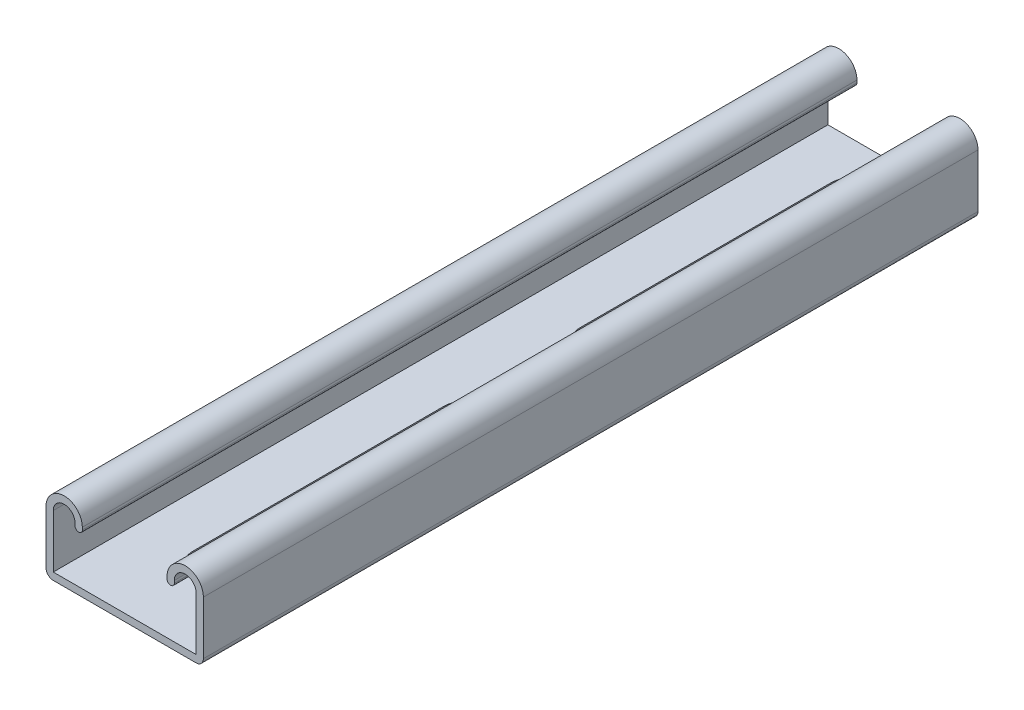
ISO-10303-21;
HEADER;
FILE_DESCRIPTION(('STEP AP214'),'2;1');
FILE_NAME('part.step','',(''),(''),'','','');
FILE_SCHEMA(('AUTOMOTIVE_DESIGN { 1 0 10303 214 1 1 1 1 }'));
ENDSEC;
DATA;
#1=APPLICATION_CONTEXT('core data for automotive mechanical design processes');
#2=APPLICATION_PROTOCOL_DEFINITION('international standard','automotive_design',2000,#1);
#3=PRODUCT_CONTEXT('',#1,'mechanical');
#4=PRODUCT('Part','Part','',(#3));
#5=PRODUCT_RELATED_PRODUCT_CATEGORY('part','',(#4));
#6=PRODUCT_DEFINITION_FORMATION('','',#4);
#7=PRODUCT_DEFINITION_CONTEXT('part definition',#1,'design');
#8=PRODUCT_DEFINITION('design','',#6,#7);
#9=PRODUCT_DEFINITION_SHAPE('','',#8);
#10=(LENGTH_UNIT() NAMED_UNIT(*) SI_UNIT(.MILLI.,.METRE.));
#11=(NAMED_UNIT(*) PLANE_ANGLE_UNIT() SI_UNIT($,.RADIAN.));
#12=(NAMED_UNIT(*) SI_UNIT($,.STERADIAN.) SOLID_ANGLE_UNIT());
#13=UNCERTAINTY_MEASURE_WITH_UNIT(LENGTH_MEASURE(1.E-05),#10,'distance_accuracy_value','');
#14=(GEOMETRIC_REPRESENTATION_CONTEXT(3) GLOBAL_UNCERTAINTY_ASSIGNED_CONTEXT((#13)) GLOBAL_UNIT_ASSIGNED_CONTEXT((#10,
#11,#12)) REPRESENTATION_CONTEXT('',''));
#15=CARTESIAN_POINT('',(0.,0.,0.));
#16=DIRECTION('',(0.,0.,1.));
#17=DIRECTION('',(1.,0.,0.));
#18=AXIS2_PLACEMENT_3D('',#15,#16,#17);
#19=CARTESIAN_POINT('',(-15.875,7.4295,203.2));
#20=DIRECTION('',(0.,0.,-1.));
#21=DIRECTION('',(-1.,0.,0.));
#22=AXIS2_PLACEMENT_3D('',#19,#20,#21);
#23=CYLINDRICAL_SURFACE('',#22,4.7625);
#24=CARTESIAN_POINT('',(-15.875,7.4295,0.));
#25=DIRECTION('',(0.,0.,1.));
#26=DIRECTION('',(-1.,0.,0.));
#27=AXIS2_PLACEMENT_3D('',#24,#25,#26);
#28=CIRCLE('',#27,4.7625);
#29=CARTESIAN_POINT('',(-11.1125,7.4295,0.));
#30=VERTEX_POINT('',#29);
#31=CARTESIAN_POINT('',(-20.6375,7.4295,0.));
#32=VERTEX_POINT('',#31);
#33=EDGE_CURVE('E253',#30,#32,#28,.T.);
#34=ORIENTED_EDGE('',*,*,#33,.T.);
#35=DIRECTION('',(0.,0.,-1.));
#36=VECTOR('',#35,1.);
#37=CARTESIAN_POINT('',(-20.6375,7.4295,203.2));
#38=LINE('',#37,#36);
#39=CARTESIAN_POINT('',(-20.6375,7.4295,203.2));
#40=VERTEX_POINT('',#39);
#41=EDGE_CURVE('E384',#40,#32,#38,.T.);
#42=ORIENTED_EDGE('',*,*,#41,.F.);
#43=CARTESIAN_POINT('',(-15.875,7.4295,203.2));
#44=DIRECTION('',(0.,0.,1.));
#45=DIRECTION('',(-1.,0.,0.));
#46=AXIS2_PLACEMENT_3D('',#43,#44,#45);
#47=CIRCLE('',#46,4.7625);
#48=CARTESIAN_POINT('',(-11.1125,7.4295,203.2));
#49=VERTEX_POINT('',#48);
#50=EDGE_CURVE('E260',#49,#40,#47,.T.);
#51=ORIENTED_EDGE('',*,*,#50,.F.);
#52=DIRECTION('',(0.,0.,-1.));
#53=VECTOR('',#52,1.);
#54=CARTESIAN_POINT('',(-11.1125,7.4295,203.2));
#55=LINE('',#54,#53);
#56=EDGE_CURVE('E298',#49,#30,#55,.T.);
#57=ORIENTED_EDGE('',*,*,#56,.T.);
#58=EDGE_LOOP('',(#34,#42,#51,#57));
#59=FACE_BOUND('',#58,.T.);
#60=ADVANCED_FACE('F32',(#59),#23,.T.);
#61=CARTESIAN_POINT('',(-20.6375,7.4295,203.2));
#62=DIRECTION('',(1.,0.,0.));
#63=DIRECTION('',(0.,0.,-1.));
#64=AXIS2_PLACEMENT_3D('',#61,#62,#63);
#65=PLANE('',#64);
#66=DIRECTION('',(0.,-1.,0.));
#67=VECTOR('',#66,1.);
#68=CARTESIAN_POINT('',(-20.6375,7.4295,0.));
#69=LINE('',#68,#67);
#70=CARTESIAN_POINT('',(-20.6375,-6.5532,0.));
#71=VERTEX_POINT('',#70);
#72=EDGE_CURVE('E301',#32,#71,#69,.T.);
#73=ORIENTED_EDGE('',*,*,#72,.T.);
#74=DIRECTION('',(0.,0.,-1.));
#75=VECTOR('',#74,1.);
#76=CARTESIAN_POINT('',(-20.6375,-6.5532,203.2));
#77=LINE('',#76,#75);
#78=CARTESIAN_POINT('',(-20.6375,-6.5532,203.2));
#79=VERTEX_POINT('',#78);
#80=EDGE_CURVE('E381',#79,#71,#77,.T.);
#81=ORIENTED_EDGE('',*,*,#80,.F.);
#82=DIRECTION('',(0.,-1.,0.));
#83=VECTOR('',#82,1.);
#84=CARTESIAN_POINT('',(-20.6375,7.4295,203.2));
#85=LINE('',#84,#83);
#86=EDGE_CURVE('E263',#40,#79,#85,.T.);
#87=ORIENTED_EDGE('',*,*,#86,.F.);
#88=ORIENTED_EDGE('',*,*,#41,.T.);
#89=EDGE_LOOP('',(#73,#81,#87,#88));
#90=FACE_BOUND('',#89,.T.);
#91=ADVANCED_FACE('F425',(#90),#65,.F.);
#92=CARTESIAN_POINT('',(-18.7325,-6.5532,203.2));
#93=DIRECTION('',(0.,0.,-1.));
#94=DIRECTION('',(-1.,0.,0.));
#95=AXIS2_PLACEMENT_3D('',#92,#93,#94);
#96=CYLINDRICAL_SURFACE('',#95,1.905);
#97=CARTESIAN_POINT('',(-18.7325,-6.5532,0.));
#98=DIRECTION('',(0.,0.,1.));
#99=DIRECTION('',(-1.,0.,0.));
#100=AXIS2_PLACEMENT_3D('',#97,#98,#99);
#101=CIRCLE('',#100,1.905);
#102=CARTESIAN_POINT('',(-18.7325,-8.4582,0.));
#103=VERTEX_POINT('',#102);
#104=EDGE_CURVE('E303',#71,#103,#101,.T.);
#105=ORIENTED_EDGE('',*,*,#104,.T.);
#106=DIRECTION('',(0.,0.,-1.));
#107=VECTOR('',#106,1.);
#108=CARTESIAN_POINT('',(-18.7325,-8.4582,203.2));
#109=LINE('',#108,#107);
#110=CARTESIAN_POINT('',(-18.7325,-8.4582,203.2));
#111=VERTEX_POINT('',#110);
#112=EDGE_CURVE('E378',#111,#103,#109,.T.);
#113=ORIENTED_EDGE('',*,*,#112,.F.);
#114=CARTESIAN_POINT('',(-18.7325,-6.5532,203.2));
#115=DIRECTION('',(0.,0.,1.));
#116=DIRECTION('',(-1.,0.,0.));
#117=AXIS2_PLACEMENT_3D('',#114,#115,#116);
#118=CIRCLE('',#117,1.905);
#119=EDGE_CURVE('E266',#79,#111,#118,.T.);
#120=ORIENTED_EDGE('',*,*,#119,.F.);
#121=ORIENTED_EDGE('',*,*,#80,.T.);
#122=EDGE_LOOP('',(#105,#113,#120,#121));
#123=FACE_BOUND('',#122,.T.);
#124=ADVANCED_FACE('F430',(#123),#96,.T.);
#125=CARTESIAN_POINT('',(-18.7325,-8.4582,203.2));
#126=DIRECTION('',(0.,1.,0.));
#127=DIRECTION('',(0.,0.,1.));
#128=AXIS2_PLACEMENT_3D('',#125,#126,#127);
#129=PLANE('',#128);
#130=DIRECTION('',(0.,0.,-1.));
#131=VECTOR('',#130,1.);
#132=CARTESIAN_POINT('',(-5.159375,-8.45820000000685,114.3));
#133=LINE('',#132,#131);
#134=CARTESIAN_POINT('',(-5.15937500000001,-8.4582,180.18125));
#135=VERTEX_POINT('',#134);
#136=CARTESIAN_POINT('',(-5.159375,-8.45820000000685,114.3));
#137=VERTEX_POINT('',#136);
#138=EDGE_CURVE('E206',#135,#137,#133,.T.);
#139=ORIENTED_EDGE('',*,*,#138,.F.);
#140=CARTESIAN_POINT('',(0.,-8.45820000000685,180.18125));
#141=DIRECTION('',(0.,-1.,0.));
#142=DIRECTION('',(0.,0.,-1.));
#143=AXIS2_PLACEMENT_3D('',#140,#141,#142);
#144=CIRCLE('',#143,5.159375);
#145=CARTESIAN_POINT('',(5.159375,-8.45820000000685,180.18125));
#146=VERTEX_POINT('',#145);
#147=EDGE_CURVE('E46',#146,#135,#144,.T.);
#148=ORIENTED_EDGE('',*,*,#147,.F.);
#149=DIRECTION('',(0.,0.,1.));
#150=VECTOR('',#149,1.);
#151=CARTESIAN_POINT('',(5.159375,-8.45820000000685,180.18125));
#152=LINE('',#151,#150);
#153=CARTESIAN_POINT('',(5.159375,-8.45820000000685,114.3));
#154=VERTEX_POINT('',#153);
#155=EDGE_CURVE('E222',#154,#146,#152,.T.);
#156=ORIENTED_EDGE('',*,*,#155,.F.);
#157=CARTESIAN_POINT('',(0.,-8.45820000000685,114.3));
#158=DIRECTION('',(0.,-1.,0.));
#159=DIRECTION('',(0.,0.,-1.));
#160=AXIS2_PLACEMENT_3D('',#157,#158,#159);
#161=CIRCLE('',#160,5.159375);
#162=EDGE_CURVE('E216',#137,#154,#161,.T.);
#163=ORIENTED_EDGE('',*,*,#162,.F.);
#164=EDGE_LOOP('',(#139,#148,#156,#163));
#165=FACE_BOUND('',#164,.T.);
#166=DIRECTION('',(0.,0.,-1.));
#167=VECTOR('',#166,1.);
#168=CARTESIAN_POINT('',(-5.159375,-8.45820000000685,12.7));
#169=LINE('',#168,#167);
#170=CARTESIAN_POINT('',(-5.15937500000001,-8.4582,78.58125));
#171=VERTEX_POINT('',#170);
#172=CARTESIAN_POINT('',(-5.159375,-8.45820000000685,12.7));
#173=VERTEX_POINT('',#172);
#174=EDGE_CURVE('E241',#171,#173,#169,.T.);
#175=ORIENTED_EDGE('',*,*,#174,.F.);
#176=CARTESIAN_POINT('',(0.,-8.45820000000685,78.58125));
#177=DIRECTION('',(0.,-1.,0.));
#178=DIRECTION('',(0.,0.,-1.));
#179=AXIS2_PLACEMENT_3D('',#176,#177,#178);
#180=CIRCLE('',#179,5.159375);
#181=CARTESIAN_POINT('',(5.159375,-8.45820000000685,78.58125));
#182=VERTEX_POINT('',#181);
#183=EDGE_CURVE('E239',#182,#171,#180,.T.);
#184=ORIENTED_EDGE('',*,*,#183,.F.);
#185=DIRECTION('',(0.,0.,1.));
#186=VECTOR('',#185,1.);
#187=CARTESIAN_POINT('',(5.159375,-8.45820000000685,78.58125));
#188=LINE('',#187,#186);
#189=CARTESIAN_POINT('',(5.159375,-8.45820000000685,12.7));
#190=VERTEX_POINT('',#189);
#191=EDGE_CURVE('E247',#190,#182,#188,.T.);
#192=ORIENTED_EDGE('',*,*,#191,.F.);
#193=CARTESIAN_POINT('',(0.,-8.45820000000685,12.7));
#194=DIRECTION('',(0.,-1.,0.));
#195=DIRECTION('',(0.,0.,-1.));
#196=AXIS2_PLACEMENT_3D('',#193,#194,#195);
#197=CIRCLE('',#196,5.159375);
#198=EDGE_CURVE('E244',#173,#190,#197,.T.);
#199=ORIENTED_EDGE('',*,*,#198,.F.);
#200=EDGE_LOOP('',(#175,#184,#192,#199));
#201=FACE_BOUND('',#200,.T.);
#202=DIRECTION('',(1.,0.,0.));
#203=VECTOR('',#202,1.);
#204=CARTESIAN_POINT('',(-18.7325,-8.4582,0.));
#205=LINE('',#204,#203);
#206=CARTESIAN_POINT('',(18.7325,-8.4582,0.));
#207=VERTEX_POINT('',#206);
#208=EDGE_CURVE('E305',#103,#207,#205,.T.);
#209=ORIENTED_EDGE('',*,*,#208,.T.);
#210=DIRECTION('',(0.,0.,-1.));
#211=VECTOR('',#210,1.);
#212=CARTESIAN_POINT('',(18.7325,-8.4582,203.2));
#213=LINE('',#212,#211);
#214=CARTESIAN_POINT('',(18.7325,-8.4582,203.2));
#215=VERTEX_POINT('',#214);
#216=EDGE_CURVE('E375',#215,#207,#213,.T.);
#217=ORIENTED_EDGE('',*,*,#216,.F.);
#218=DIRECTION('',(1.,0.,0.));
#219=VECTOR('',#218,1.);
#220=CARTESIAN_POINT('',(-18.7325,-8.4582,203.2));
#221=LINE('',#220,#219);
#222=EDGE_CURVE('E268',#111,#215,#221,.T.);
#223=ORIENTED_EDGE('',*,*,#222,.F.);
#224=ORIENTED_EDGE('',*,*,#112,.T.);
#225=EDGE_LOOP('',(#209,#217,#223,#224));
#226=FACE_BOUND('',#225,.T.);
#227=ADVANCED_FACE('F220',(#165,#201,#226),#129,.F.);
#228=CARTESIAN_POINT('',(18.7325,-6.5532,203.2));
#229=DIRECTION('',(0.,0.,-1.));
#230=DIRECTION('',(-1.,0.,0.));
#231=AXIS2_PLACEMENT_3D('',#228,#229,#230);
#232=CYLINDRICAL_SURFACE('',#231,1.905);
#233=CARTESIAN_POINT('',(18.7325,-6.5532,0.));
#234=DIRECTION('',(0.,0.,1.));
#235=DIRECTION('',(1.,0.,0.));
#236=AXIS2_PLACEMENT_3D('',#233,#234,#235);
#237=CIRCLE('',#236,1.905);
#238=CARTESIAN_POINT('',(20.6375,-6.5532,0.));
#239=VERTEX_POINT('',#238);
#240=EDGE_CURVE('E307',#207,#239,#237,.T.);
#241=ORIENTED_EDGE('',*,*,#240,.T.);
#242=DIRECTION('',(0.,0.,-1.));
#243=VECTOR('',#242,1.);
#244=CARTESIAN_POINT('',(20.6375,-6.5532,203.2));
#245=LINE('',#244,#243);
#246=CARTESIAN_POINT('',(20.6375,-6.5532,203.2));
#247=VERTEX_POINT('',#246);
#248=EDGE_CURVE('E372',#247,#239,#245,.T.);
#249=ORIENTED_EDGE('',*,*,#248,.F.);
#250=CARTESIAN_POINT('',(18.7325,-6.5532,203.2));
#251=DIRECTION('',(0.,0.,1.));
#252=DIRECTION('',(1.,0.,0.));
#253=AXIS2_PLACEMENT_3D('',#250,#251,#252);
#254=CIRCLE('',#253,1.905);
#255=EDGE_CURVE('E270',#215,#247,#254,.T.);
#256=ORIENTED_EDGE('',*,*,#255,.F.);
#257=ORIENTED_EDGE('',*,*,#216,.T.);
#258=EDGE_LOOP('',(#241,#249,#256,#257));
#259=FACE_BOUND('',#258,.T.);
#260=ADVANCED_FACE('F510',(#259),#232,.T.);
#261=CARTESIAN_POINT('',(20.6375,-6.5532,203.2));
#262=DIRECTION('',(-1.,0.,0.));
#263=DIRECTION('',(0.,-1.,0.));
#264=AXIS2_PLACEMENT_3D('',#261,#262,#263);
#265=PLANE('',#264);
#266=DIRECTION('',(0.,1.,0.));
#267=VECTOR('',#266,1.);
#268=CARTESIAN_POINT('',(20.6375,-6.5532,0.));
#269=LINE('',#268,#267);
#270=CARTESIAN_POINT('',(20.6375,7.4295,0.));
#271=VERTEX_POINT('',#270);
#272=EDGE_CURVE('E309',#239,#271,#269,.T.);
#273=ORIENTED_EDGE('',*,*,#272,.T.);
#274=DIRECTION('',(0.,0.,-1.));
#275=VECTOR('',#274,1.);
#276=CARTESIAN_POINT('',(20.6375,7.4295,203.2));
#277=LINE('',#276,#275);
#278=CARTESIAN_POINT('',(20.6375,7.4295,203.2));
#279=VERTEX_POINT('',#278);
#280=EDGE_CURVE('E369',#279,#271,#277,.T.);
#281=ORIENTED_EDGE('',*,*,#280,.F.);
#282=DIRECTION('',(0.,1.,0.));
#283=VECTOR('',#282,1.);
#284=CARTESIAN_POINT('',(20.6375,-6.5532,203.2));
#285=LINE('',#284,#283);
#286=EDGE_CURVE('E272',#247,#279,#285,.T.);
#287=ORIENTED_EDGE('',*,*,#286,.F.);
#288=ORIENTED_EDGE('',*,*,#248,.T.);
#289=EDGE_LOOP('',(#273,#281,#287,#288));
#290=FACE_BOUND('',#289,.T.);
#291=ADVANCED_FACE('F506',(#290),#265,.F.);
#292=CARTESIAN_POINT('',(15.875,7.4295,203.2));
#293=DIRECTION('',(0.,0.,-1.));
#294=DIRECTION('',(-1.,0.,0.));
#295=AXIS2_PLACEMENT_3D('',#292,#293,#294);
#296=CYLINDRICAL_SURFACE('',#295,4.7625);
#297=CARTESIAN_POINT('',(15.875,7.4295,0.));
#298=DIRECTION('',(0.,0.,1.));
#299=DIRECTION('',(1.,0.,0.));
#300=AXIS2_PLACEMENT_3D('',#297,#298,#299);
#301=CIRCLE('',#300,4.7625);
#302=CARTESIAN_POINT('',(11.1125,7.4295,0.));
#303=VERTEX_POINT('',#302);
#304=EDGE_CURVE('E311',#271,#303,#301,.T.);
#305=ORIENTED_EDGE('',*,*,#304,.T.);
#306=DIRECTION('',(0.,0.,-1.));
#307=VECTOR('',#306,1.);
#308=CARTESIAN_POINT('',(11.1125,7.4295,203.2));
#309=LINE('',#308,#307);
#310=CARTESIAN_POINT('',(11.1125,7.4295,203.2));
#311=VERTEX_POINT('',#310);
#312=EDGE_CURVE('E366',#311,#303,#309,.T.);
#313=ORIENTED_EDGE('',*,*,#312,.F.);
#314=CARTESIAN_POINT('',(15.875,7.4295,203.2));
#315=DIRECTION('',(0.,0.,1.));
#316=DIRECTION('',(1.,0.,0.));
#317=AXIS2_PLACEMENT_3D('',#314,#315,#316);
#318=CIRCLE('',#317,4.7625);
#319=EDGE_CURVE('E274',#279,#311,#318,.T.);
#320=ORIENTED_EDGE('',*,*,#319,.F.);
#321=ORIENTED_EDGE('',*,*,#280,.T.);
#322=EDGE_LOOP('',(#305,#313,#320,#321));
#323=FACE_BOUND('',#322,.T.);
#324=ADVANCED_FACE('F501',(#323),#296,.T.);
#325=CARTESIAN_POINT('',(11.1125,7.4295,203.2));
#326=DIRECTION('',(1.,0.,0.));
#327=DIRECTION('',(0.,1.,0.));
#328=AXIS2_PLACEMENT_3D('',#325,#326,#327);
#329=PLANE('',#328);
#330=DIRECTION('',(0.,-1.,0.));
#331=VECTOR('',#330,1.);
#332=CARTESIAN_POINT('',(11.1125,7.4295,0.));
#333=LINE('',#332,#331);
#334=CARTESIAN_POINT('',(11.1125,6.7945,0.));
#335=VERTEX_POINT('',#334);
#336=EDGE_CURVE('E313',#303,#335,#333,.T.);
#337=ORIENTED_EDGE('',*,*,#336,.T.);
#338=DIRECTION('',(0.,0.,-1.));
#339=VECTOR('',#338,1.);
#340=CARTESIAN_POINT('',(11.1125,6.7945,203.2));
#341=LINE('',#340,#339);
#342=CARTESIAN_POINT('',(11.1125,6.7945,203.2));
#343=VERTEX_POINT('',#342);
#344=EDGE_CURVE('E363',#343,#335,#341,.T.);
#345=ORIENTED_EDGE('',*,*,#344,.F.);
#346=DIRECTION('',(0.,-1.,0.));
#347=VECTOR('',#346,1.);
#348=CARTESIAN_POINT('',(11.1125,7.4295,203.2));
#349=LINE('',#348,#347);
#350=EDGE_CURVE('E276',#311,#343,#349,.T.);
#351=ORIENTED_EDGE('',*,*,#350,.F.);
#352=ORIENTED_EDGE('',*,*,#312,.T.);
#353=EDGE_LOOP('',(#337,#345,#351,#352));
#354=FACE_BOUND('',#353,.T.);
#355=ADVANCED_FACE('F495',(#354),#329,.F.);
#356=CARTESIAN_POINT('',(12.065,6.7945,203.2));
#357=DIRECTION('',(0.,0.,-1.));
#358=DIRECTION('',(-1.,0.,0.));
#359=AXIS2_PLACEMENT_3D('',#356,#357,#358);
#360=CYLINDRICAL_SURFACE('',#359,0.952500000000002);
#361=CARTESIAN_POINT('',(12.065,6.7945,0.));
#362=DIRECTION('',(0.,0.,1.));
#363=DIRECTION('',(1.,0.,0.));
#364=AXIS2_PLACEMENT_3D('',#361,#362,#363);
#365=CIRCLE('',#364,0.952500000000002);
#366=CARTESIAN_POINT('',(13.0175,6.7945,0.));
#367=VERTEX_POINT('',#366);
#368=EDGE_CURVE('E315',#335,#367,#365,.T.);
#369=ORIENTED_EDGE('',*,*,#368,.T.);
#370=DIRECTION('',(0.,0.,-1.));
#371=VECTOR('',#370,1.);
#372=CARTESIAN_POINT('',(13.0175,6.7945,203.2));
#373=LINE('',#372,#371);
#374=CARTESIAN_POINT('',(13.0175,6.7945,203.2));
#375=VERTEX_POINT('',#374);
#376=EDGE_CURVE('E360',#375,#367,#373,.T.);
#377=ORIENTED_EDGE('',*,*,#376,.F.);
#378=CARTESIAN_POINT('',(12.065,6.7945,203.2));
#379=DIRECTION('',(0.,0.,1.));
#380=DIRECTION('',(1.,0.,0.));
#381=AXIS2_PLACEMENT_3D('',#378,#379,#380);
#382=CIRCLE('',#381,0.952500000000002);
#383=EDGE_CURVE('E278',#343,#375,#382,.T.);
#384=ORIENTED_EDGE('',*,*,#383,.F.);
#385=ORIENTED_EDGE('',*,*,#344,.T.);
#386=EDGE_LOOP('',(#369,#377,#384,#385));
#387=FACE_BOUND('',#386,.T.);
#388=ADVANCED_FACE('F491',(#387),#360,.T.);
#389=CARTESIAN_POINT('',(13.0175,7.4295,203.2));
#390=DIRECTION('',(-1.,0.,0.));
#391=DIRECTION('',(0.,-1.,0.));
#392=AXIS2_PLACEMENT_3D('',#389,#390,#391);
#393=PLANE('',#392);
#394=DIRECTION('',(0.,1.,0.));
#395=VECTOR('',#394,1.);
#396=CARTESIAN_POINT('',(13.0175,7.4295,0.));
#397=LINE('',#396,#395);
#398=CARTESIAN_POINT('',(13.0175,7.4295,0.));
#399=VERTEX_POINT('',#398);
#400=EDGE_CURVE('E317',#367,#399,#397,.T.);
#401=ORIENTED_EDGE('',*,*,#400,.T.);
#402=DIRECTION('',(0.,0.,-1.));
#403=VECTOR('',#402,1.);
#404=CARTESIAN_POINT('',(13.0175,7.4295,203.2));
#405=LINE('',#404,#403);
#406=CARTESIAN_POINT('',(13.0175,7.4295,203.2));
#407=VERTEX_POINT('',#406);
#408=EDGE_CURVE('E357',#407,#399,#405,.T.);
#409=ORIENTED_EDGE('',*,*,#408,.F.);
#410=DIRECTION('',(0.,1.,0.));
#411=VECTOR('',#410,1.);
#412=CARTESIAN_POINT('',(13.0175,7.4295,203.2));
#413=LINE('',#412,#411);
#414=EDGE_CURVE('E280',#375,#407,#413,.T.);
#415=ORIENTED_EDGE('',*,*,#414,.F.);
#416=ORIENTED_EDGE('',*,*,#376,.T.);
#417=EDGE_LOOP('',(#401,#409,#415,#416));
#418=FACE_BOUND('',#417,.T.);
#419=ADVANCED_FACE('F486',(#418),#393,.F.);
#420=CARTESIAN_POINT('',(15.875,7.4295,203.2));
#421=DIRECTION('',(0.,0.,-1.));
#422=DIRECTION('',(-1.,0.,0.));
#423=AXIS2_PLACEMENT_3D('',#420,#421,#422);
#424=CYLINDRICAL_SURFACE('',#423,2.8575);
#425=CARTESIAN_POINT('',(15.875,7.4295,0.));
#426=DIRECTION('',(0.,0.,-1.));
#427=DIRECTION('',(1.,0.,0.));
#428=AXIS2_PLACEMENT_3D('',#425,#426,#427);
#429=CIRCLE('',#428,2.8575);
#430=CARTESIAN_POINT('',(18.7325,7.4295,0.));
#431=VERTEX_POINT('',#430);
#432=EDGE_CURVE('E319',#399,#431,#429,.T.);
#433=ORIENTED_EDGE('',*,*,#432,.T.);
#434=DIRECTION('',(0.,0.,-1.));
#435=VECTOR('',#434,1.);
#436=CARTESIAN_POINT('',(18.7325,7.4295,203.2));
#437=LINE('',#436,#435);
#438=CARTESIAN_POINT('',(18.7325,7.4295,203.2));
#439=VERTEX_POINT('',#438);
#440=EDGE_CURVE('E354',#439,#431,#437,.T.);
#441=ORIENTED_EDGE('',*,*,#440,.F.);
#442=CARTESIAN_POINT('',(15.875,7.4295,203.2));
#443=DIRECTION('',(0.,0.,-1.));
#444=DIRECTION('',(1.,0.,0.));
#445=AXIS2_PLACEMENT_3D('',#442,#443,#444);
#446=CIRCLE('',#445,2.8575);
#447=EDGE_CURVE('E282',#407,#439,#446,.T.);
#448=ORIENTED_EDGE('',*,*,#447,.F.);
#449=ORIENTED_EDGE('',*,*,#408,.T.);
#450=EDGE_LOOP('',(#433,#441,#448,#449));
#451=FACE_BOUND('',#450,.T.);
#452=ADVANCED_FACE('F480',(#451),#424,.F.);
#453=CARTESIAN_POINT('',(18.7325,-6.5532,203.2));
#454=DIRECTION('',(1.,0.,0.));
#455=DIRECTION('',(0.,1.,0.));
#456=AXIS2_PLACEMENT_3D('',#453,#454,#455);
#457=PLANE('',#456);
#458=DIRECTION('',(0.,-1.,0.));
#459=VECTOR('',#458,1.);
#460=CARTESIAN_POINT('',(18.7325,-6.5532,0.));
#461=LINE('',#460,#459);
#462=CARTESIAN_POINT('',(18.7325,-6.5532,0.));
#463=VERTEX_POINT('',#462);
#464=EDGE_CURVE('E321',#431,#463,#461,.T.);
#465=ORIENTED_EDGE('',*,*,#464,.T.);
#466=DIRECTION('',(0.,0.,-1.));
#467=VECTOR('',#466,1.);
#468=CARTESIAN_POINT('',(18.7325,-6.5532,203.2));
#469=LINE('',#468,#467);
#470=CARTESIAN_POINT('',(18.7325,-6.5532,203.2));
#471=VERTEX_POINT('',#470);
#472=EDGE_CURVE('E351',#471,#463,#469,.T.);
#473=ORIENTED_EDGE('',*,*,#472,.F.);
#474=DIRECTION('',(0.,-1.,0.));
#475=VECTOR('',#474,1.);
#476=CARTESIAN_POINT('',(18.7325,-6.5532,203.2));
#477=LINE('',#476,#475);
#478=EDGE_CURVE('E284',#439,#471,#477,.T.);
#479=ORIENTED_EDGE('',*,*,#478,.F.);
#480=ORIENTED_EDGE('',*,*,#440,.T.);
#481=EDGE_LOOP('',(#465,#473,#479,#480));
#482=FACE_BOUND('',#481,.T.);
#483=ADVANCED_FACE('F476',(#482),#457,.F.);
#484=CARTESIAN_POINT('',(-18.7325,-6.5532,203.2));
#485=DIRECTION('',(0.,-1.,0.));
#486=DIRECTION('',(0.,0.,-1.));
#487=AXIS2_PLACEMENT_3D('',#484,#485,#486);
#488=PLANE('',#487);
#489=DIRECTION('',(0.,0.,1.));
#490=VECTOR('',#489,1.);
#491=CARTESIAN_POINT('',(5.159375,-6.5532,304.8));
#492=LINE('',#491,#490);
#493=CARTESIAN_POINT('',(5.159375,-6.5532,114.3));
#494=VERTEX_POINT('',#493);
#495=CARTESIAN_POINT('',(5.159375,-6.5532,180.18125));
#496=VERTEX_POINT('',#495);
#497=EDGE_CURVE('E232',#494,#496,#492,.T.);
#498=ORIENTED_EDGE('',*,*,#497,.T.);
#499=CARTESIAN_POINT('',(0.,-6.5532,180.18125));
#500=DIRECTION('',(0.,-1.,0.));
#501=DIRECTION('',(0.,0.,-1.));
#502=AXIS2_PLACEMENT_3D('',#499,#500,#501);
#503=CIRCLE('',#502,5.159375);
#504=CARTESIAN_POINT('',(-5.15937500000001,-6.5532,180.18125));
#505=VERTEX_POINT('',#504);
#506=EDGE_CURVE('E236',#496,#505,#503,.T.);
#507=ORIENTED_EDGE('',*,*,#506,.T.);
#508=DIRECTION('',(0.,0.,-1.));
#509=VECTOR('',#508,1.);
#510=CARTESIAN_POINT('',(-5.15937500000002,-6.5532,304.8));
#511=LINE('',#510,#509);
#512=CARTESIAN_POINT('',(-5.159375,-6.5532,114.3));
#513=VERTEX_POINT('',#512);
#514=EDGE_CURVE('E213',#505,#513,#511,.T.);
#515=ORIENTED_EDGE('',*,*,#514,.T.);
#516=CARTESIAN_POINT('',(0.,-6.5532,114.3));
#517=DIRECTION('',(0.,-1.,0.));
#518=DIRECTION('',(0.,0.,-1.));
#519=AXIS2_PLACEMENT_3D('',#516,#517,#518);
#520=CIRCLE('',#519,5.159375);
#521=EDGE_CURVE('E54',#513,#494,#520,.T.);
#522=ORIENTED_EDGE('',*,*,#521,.T.);
#523=EDGE_LOOP('',(#498,#507,#515,#522));
#524=FACE_BOUND('',#523,.T.);
#525=DIRECTION('',(0.,0.,1.));
#526=VECTOR('',#525,1.);
#527=CARTESIAN_POINT('',(5.159375,-6.5532,203.2));
#528=LINE('',#527,#526);
#529=CARTESIAN_POINT('',(5.159375,-6.5532,12.7));
#530=VERTEX_POINT('',#529);
#531=CARTESIAN_POINT('',(5.159375,-6.5532,78.58125));
#532=VERTEX_POINT('',#531);
#533=EDGE_CURVE('E39',#530,#532,#528,.T.);
#534=ORIENTED_EDGE('',*,*,#533,.T.);
#535=CARTESIAN_POINT('',(0.,-6.5532,78.58125));
#536=DIRECTION('',(0.,-1.,0.));
#537=DIRECTION('',(0.,0.,-1.));
#538=AXIS2_PLACEMENT_3D('',#535,#536,#537);
#539=CIRCLE('',#538,5.159375);
#540=CARTESIAN_POINT('',(-5.15937500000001,-6.5532,78.58125));
#541=VERTEX_POINT('',#540);
#542=EDGE_CURVE('E11',#532,#541,#539,.T.);
#543=ORIENTED_EDGE('',*,*,#542,.T.);
#544=DIRECTION('',(0.,0.,-1.));
#545=VECTOR('',#544,1.);
#546=CARTESIAN_POINT('',(-5.15937500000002,-6.5532,203.2));
#547=LINE('',#546,#545);
#548=CARTESIAN_POINT('',(-5.159375,-6.5532,12.7));
#549=VERTEX_POINT('',#548);
#550=EDGE_CURVE('E387',#541,#549,#547,.T.);
#551=ORIENTED_EDGE('',*,*,#550,.T.);
#552=CARTESIAN_POINT('',(0.,-6.5532,12.7));
#553=DIRECTION('',(0.,-1.,0.));
#554=DIRECTION('',(0.,0.,-1.));
#555=AXIS2_PLACEMENT_3D('',#552,#553,#554);
#556=CIRCLE('',#555,5.159375);
#557=EDGE_CURVE('E390',#549,#530,#556,.T.);
#558=ORIENTED_EDGE('',*,*,#557,.T.);
#559=EDGE_LOOP('',(#534,#543,#551,#558));
#560=FACE_BOUND('',#559,.T.);
#561=DIRECTION('',(-1.,0.,0.));
#562=VECTOR('',#561,1.);
#563=CARTESIAN_POINT('',(-18.7325,-6.5532,0.));
#564=LINE('',#563,#562);
#565=CARTESIAN_POINT('',(-18.7325,-6.5532,0.));
#566=VERTEX_POINT('',#565);
#567=EDGE_CURVE('E323',#463,#566,#564,.T.);
#568=ORIENTED_EDGE('',*,*,#567,.T.);
#569=DIRECTION('',(0.,0.,-1.));
#570=VECTOR('',#569,1.);
#571=CARTESIAN_POINT('',(-18.7325,-6.5532,203.2));
#572=LINE('',#571,#570);
#573=CARTESIAN_POINT('',(-18.7325,-6.5532,203.2));
#574=VERTEX_POINT('',#573);
#575=EDGE_CURVE('E348',#574,#566,#572,.T.);
#576=ORIENTED_EDGE('',*,*,#575,.F.);
#577=DIRECTION('',(-1.,0.,0.));
#578=VECTOR('',#577,1.);
#579=CARTESIAN_POINT('',(-18.7325,-6.5532,203.2));
#580=LINE('',#579,#578);
#581=EDGE_CURVE('E286',#471,#574,#580,.T.);
#582=ORIENTED_EDGE('',*,*,#581,.F.);
#583=ORIENTED_EDGE('',*,*,#472,.T.);
#584=EDGE_LOOP('',(#568,#576,#582,#583));
#585=FACE_BOUND('',#584,.T.);
#586=ADVANCED_FACE('F394',(#524,#560,#585),#488,.F.);
#587=CARTESIAN_POINT('',(-18.7325,7.4295,203.2));
#588=DIRECTION('',(-1.,0.,0.));
#589=DIRECTION('',(0.,0.,1.));
#590=AXIS2_PLACEMENT_3D('',#587,#588,#589);
#591=PLANE('',#590);
#592=DIRECTION('',(0.,1.,0.));
#593=VECTOR('',#592,1.);
#594=CARTESIAN_POINT('',(-18.7325,7.4295,0.));
#595=LINE('',#594,#593);
#596=CARTESIAN_POINT('',(-18.7325,7.4295,0.));
#597=VERTEX_POINT('',#596);
#598=EDGE_CURVE('E325',#566,#597,#595,.T.);
#599=ORIENTED_EDGE('',*,*,#598,.T.);
#600=DIRECTION('',(0.,0.,-1.));
#601=VECTOR('',#600,1.);
#602=CARTESIAN_POINT('',(-18.7325,7.4295,203.2));
#603=LINE('',#602,#601);
#604=CARTESIAN_POINT('',(-18.7325,7.4295,203.2));
#605=VERTEX_POINT('',#604);
#606=EDGE_CURVE('E345',#605,#597,#603,.T.);
#607=ORIENTED_EDGE('',*,*,#606,.F.);
#608=DIRECTION('',(0.,1.,0.));
#609=VECTOR('',#608,1.);
#610=CARTESIAN_POINT('',(-18.7325,7.4295,203.2));
#611=LINE('',#610,#609);
#612=EDGE_CURVE('E288',#574,#605,#611,.T.);
#613=ORIENTED_EDGE('',*,*,#612,.F.);
#614=ORIENTED_EDGE('',*,*,#575,.T.);
#615=EDGE_LOOP('',(#599,#607,#613,#614));
#616=FACE_BOUND('',#615,.T.);
#617=ADVANCED_FACE('F467',(#616),#591,.F.);
#618=CARTESIAN_POINT('',(-15.875,7.4295,203.2));
#619=DIRECTION('',(0.,0.,-1.));
#620=DIRECTION('',(-1.,0.,0.));
#621=AXIS2_PLACEMENT_3D('',#618,#619,#620);
#622=CYLINDRICAL_SURFACE('',#621,2.8575);
#623=CARTESIAN_POINT('',(-15.875,7.4295,0.));
#624=DIRECTION('',(0.,0.,-1.));
#625=DIRECTION('',(-1.,0.,0.));
#626=AXIS2_PLACEMENT_3D('',#623,#624,#625);
#627=CIRCLE('',#626,2.8575);
#628=CARTESIAN_POINT('',(-13.0175,7.4295,0.));
#629=VERTEX_POINT('',#628);
#630=EDGE_CURVE('E327',#597,#629,#627,.T.);
#631=ORIENTED_EDGE('',*,*,#630,.T.);
#632=DIRECTION('',(0.,0.,-1.));
#633=VECTOR('',#632,1.);
#634=CARTESIAN_POINT('',(-13.0175,7.4295,203.2));
#635=LINE('',#634,#633);
#636=CARTESIAN_POINT('',(-13.0175,7.4295,203.2));
#637=VERTEX_POINT('',#636);
#638=EDGE_CURVE('E342',#637,#629,#635,.T.);
#639=ORIENTED_EDGE('',*,*,#638,.F.);
#640=CARTESIAN_POINT('',(-15.875,7.4295,203.2));
#641=DIRECTION('',(0.,0.,-1.));
#642=DIRECTION('',(-1.,0.,0.));
#643=AXIS2_PLACEMENT_3D('',#640,#641,#642);
#644=CIRCLE('',#643,2.8575);
#645=EDGE_CURVE('E290',#605,#637,#644,.T.);
#646=ORIENTED_EDGE('',*,*,#645,.F.);
#647=ORIENTED_EDGE('',*,*,#606,.T.);
#648=EDGE_LOOP('',(#631,#639,#646,#647));
#649=FACE_BOUND('',#648,.T.);
#650=ADVANCED_FACE('F463',(#649),#622,.F.);
#651=CARTESIAN_POINT('',(-13.0175,7.4295,203.2));
#652=DIRECTION('',(1.,0.,0.));
#653=DIRECTION('',(0.,1.,0.));
#654=AXIS2_PLACEMENT_3D('',#651,#652,#653);
#655=PLANE('',#654);
#656=DIRECTION('',(0.,-1.,0.));
#657=VECTOR('',#656,1.);
#658=CARTESIAN_POINT('',(-13.0175,7.4295,0.));
#659=LINE('',#658,#657);
#660=CARTESIAN_POINT('',(-13.0175,6.7945,0.));
#661=VERTEX_POINT('',#660);
#662=EDGE_CURVE('E329',#629,#661,#659,.T.);
#663=ORIENTED_EDGE('',*,*,#662,.T.);
#664=DIRECTION('',(0.,0.,-1.));
#665=VECTOR('',#664,1.);
#666=CARTESIAN_POINT('',(-13.0175,6.7945,203.2));
#667=LINE('',#666,#665);
#668=CARTESIAN_POINT('',(-13.0175,6.7945,203.2));
#669=VERTEX_POINT('',#668);
#670=EDGE_CURVE('E339',#669,#661,#667,.T.);
#671=ORIENTED_EDGE('',*,*,#670,.F.);
#672=DIRECTION('',(0.,-1.,0.));
#673=VECTOR('',#672,1.);
#674=CARTESIAN_POINT('',(-13.0175,7.4295,203.2));
#675=LINE('',#674,#673);
#676=EDGE_CURVE('E292',#637,#669,#675,.T.);
#677=ORIENTED_EDGE('',*,*,#676,.F.);
#678=ORIENTED_EDGE('',*,*,#638,.T.);
#679=EDGE_LOOP('',(#663,#671,#677,#678));
#680=FACE_BOUND('',#679,.T.);
#681=ADVANCED_FACE('F458',(#680),#655,.F.);
#682=CARTESIAN_POINT('',(-12.065,6.7945,203.2));
#683=DIRECTION('',(0.,0.,-1.));
#684=DIRECTION('',(-1.,0.,0.));
#685=AXIS2_PLACEMENT_3D('',#682,#683,#684);
#686=CYLINDRICAL_SURFACE('',#685,0.952499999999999);
#687=CARTESIAN_POINT('',(-12.065,6.7945,0.));
#688=DIRECTION('',(0.,0.,1.));
#689=DIRECTION('',(-1.,0.,0.));
#690=AXIS2_PLACEMENT_3D('',#687,#688,#689);
#691=CIRCLE('',#690,0.952499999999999);
#692=CARTESIAN_POINT('',(-11.1125,6.7945,0.));
#693=VERTEX_POINT('',#692);
#694=EDGE_CURVE('E331',#661,#693,#691,.T.);
#695=ORIENTED_EDGE('',*,*,#694,.T.);
#696=DIRECTION('',(0.,0.,-1.));
#697=VECTOR('',#696,1.);
#698=CARTESIAN_POINT('',(-11.1125,6.7945,203.2));
#699=LINE('',#698,#697);
#700=CARTESIAN_POINT('',(-11.1125,6.7945,203.2));
#701=VERTEX_POINT('',#700);
#702=EDGE_CURVE('E336',#701,#693,#699,.T.);
#703=ORIENTED_EDGE('',*,*,#702,.F.);
#704=CARTESIAN_POINT('',(-12.065,6.7945,203.2));
#705=DIRECTION('',(0.,0.,1.));
#706=DIRECTION('',(-1.,0.,0.));
#707=AXIS2_PLACEMENT_3D('',#704,#705,#706);
#708=CIRCLE('',#707,0.952499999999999);
#709=EDGE_CURVE('E294',#669,#701,#708,.T.);
#710=ORIENTED_EDGE('',*,*,#709,.F.);
#711=ORIENTED_EDGE('',*,*,#670,.T.);
#712=EDGE_LOOP('',(#695,#703,#710,#711));
#713=FACE_BOUND('',#712,.T.);
#714=ADVANCED_FACE('F452',(#713),#686,.T.);
#715=CARTESIAN_POINT('',(-11.1125,7.4295,203.2));
#716=DIRECTION('',(-1.,0.,0.));
#717=DIRECTION('',(0.,-1.,0.));
#718=AXIS2_PLACEMENT_3D('',#715,#716,#717);
#719=PLANE('',#718);
#720=DIRECTION('',(0.,1.,0.));
#721=VECTOR('',#720,1.);
#722=CARTESIAN_POINT('',(-11.1125,7.4295,0.));
#723=LINE('',#722,#721);
#724=EDGE_CURVE('E264',#693,#30,#723,.T.);
#725=ORIENTED_EDGE('',*,*,#724,.T.);
#726=ORIENTED_EDGE('',*,*,#56,.F.);
#727=DIRECTION('',(0.,1.,0.));
#728=VECTOR('',#727,1.);
#729=CARTESIAN_POINT('',(-11.1125,7.4295,203.2));
#730=LINE('',#729,#728);
#731=EDGE_CURVE('E296',#701,#49,#730,.T.);
#732=ORIENTED_EDGE('',*,*,#731,.F.);
#733=ORIENTED_EDGE('',*,*,#702,.T.);
#734=EDGE_LOOP('',(#725,#726,#732,#733));
#735=FACE_BOUND('',#734,.T.);
#736=ADVANCED_FACE('F450',(#735),#719,.F.);
#737=CARTESIAN_POINT('',(-15.875,7.4295,203.2));
#738=DIRECTION('',(0.,0.,-1.));
#739=DIRECTION('',(-1.,0.,0.));
#740=AXIS2_PLACEMENT_3D('',#737,#738,#739);
#741=PLANE('',#740);
#742=ORIENTED_EDGE('',*,*,#50,.T.);
#743=ORIENTED_EDGE('',*,*,#86,.T.);
#744=ORIENTED_EDGE('',*,*,#119,.T.);
#745=ORIENTED_EDGE('',*,*,#222,.T.);
#746=ORIENTED_EDGE('',*,*,#255,.T.);
#747=ORIENTED_EDGE('',*,*,#286,.T.);
#748=ORIENTED_EDGE('',*,*,#319,.T.);
#749=ORIENTED_EDGE('',*,*,#350,.T.);
#750=ORIENTED_EDGE('',*,*,#383,.T.);
#751=ORIENTED_EDGE('',*,*,#414,.T.);
#752=ORIENTED_EDGE('',*,*,#447,.T.);
#753=ORIENTED_EDGE('',*,*,#478,.T.);
#754=ORIENTED_EDGE('',*,*,#581,.T.);
#755=ORIENTED_EDGE('',*,*,#612,.T.);
#756=ORIENTED_EDGE('',*,*,#645,.T.);
#757=ORIENTED_EDGE('',*,*,#676,.T.);
#758=ORIENTED_EDGE('',*,*,#709,.T.);
#759=ORIENTED_EDGE('',*,*,#731,.T.);
#760=EDGE_LOOP('',(#742,#743,#744,#745,#746,#747,#748,#749,#750,#751,#752,#753,#754,#755,#756,
#757,#758,#759));
#761=FACE_BOUND('',#760,.T.);
#762=ADVANCED_FACE('F445',(#761),#741,.F.);
#763=CARTESIAN_POINT('',(-15.875,7.4295,0.));
#764=DIRECTION('',(0.,0.,-1.));
#765=DIRECTION('',(-1.,0.,0.));
#766=AXIS2_PLACEMENT_3D('',#763,#764,#765);
#767=PLANE('',#766);
#768=ORIENTED_EDGE('',*,*,#33,.F.);
#769=ORIENTED_EDGE('',*,*,#724,.F.);
#770=ORIENTED_EDGE('',*,*,#694,.F.);
#771=ORIENTED_EDGE('',*,*,#662,.F.);
#772=ORIENTED_EDGE('',*,*,#630,.F.);
#773=ORIENTED_EDGE('',*,*,#598,.F.);
#774=ORIENTED_EDGE('',*,*,#567,.F.);
#775=ORIENTED_EDGE('',*,*,#464,.F.);
#776=ORIENTED_EDGE('',*,*,#432,.F.);
#777=ORIENTED_EDGE('',*,*,#400,.F.);
#778=ORIENTED_EDGE('',*,*,#368,.F.);
#779=ORIENTED_EDGE('',*,*,#336,.F.);
#780=ORIENTED_EDGE('',*,*,#304,.F.);
#781=ORIENTED_EDGE('',*,*,#272,.F.);
#782=ORIENTED_EDGE('',*,*,#240,.F.);
#783=ORIENTED_EDGE('',*,*,#208,.F.);
#784=ORIENTED_EDGE('',*,*,#104,.F.);
#785=ORIENTED_EDGE('',*,*,#72,.F.);
#786=EDGE_LOOP('',(#768,#769,#770,#771,#772,#773,#774,#775,#776,#777,#778,#779,#780,#781,#782,
#783,#784,#785));
#787=FACE_BOUND('',#786,.T.);
#788=ADVANCED_FACE('F438',(#787),#767,.T.);
#789=CARTESIAN_POINT('',(0.,12.192,78.58125));
#790=DIRECTION('',(0.,-1.,0.));
#791=DIRECTION('',(0.,0.,-1.));
#792=AXIS2_PLACEMENT_3D('',#789,#790,#791);
#793=CYLINDRICAL_SURFACE('',#792,5.159375);
#794=DIRECTION('',(0.,-1.,0.));
#795=VECTOR('',#794,1.);
#796=CARTESIAN_POINT('',(5.159375,12.192,78.58125));
#797=LINE('',#796,#795);
#798=EDGE_CURVE('E251',#532,#182,#797,.T.);
#799=ORIENTED_EDGE('',*,*,#798,.T.);
#800=ORIENTED_EDGE('',*,*,#183,.T.);
#801=DIRECTION('',(0.,-1.,0.));
#802=VECTOR('',#801,1.);
#803=CARTESIAN_POINT('',(-5.15937500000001,12.192,78.58125));
#804=LINE('',#803,#802);
#805=EDGE_CURVE('E250',#541,#171,#804,.T.);
#806=ORIENTED_EDGE('',*,*,#805,.F.);
#807=ORIENTED_EDGE('',*,*,#542,.F.);
#808=EDGE_LOOP('',(#799,#800,#806,#807));
#809=FACE_BOUND('',#808,.T.);
#810=ADVANCED_FACE('F410',(#809),#793,.F.);
#811=CARTESIAN_POINT('',(5.159375,12.192,78.58125));
#812=DIRECTION('',(1.,0.,0.));
#813=DIRECTION('',(0.,0.,-1.));
#814=AXIS2_PLACEMENT_3D('',#811,#812,#813);
#815=PLANE('',#814);
#816=DIRECTION('',(0.,-1.,0.));
#817=VECTOR('',#816,1.);
#818=CARTESIAN_POINT('',(5.159375,12.192,12.7));
#819=LINE('',#818,#817);
#820=EDGE_CURVE('E254',#530,#190,#819,.T.);
#821=ORIENTED_EDGE('',*,*,#820,.T.);
#822=ORIENTED_EDGE('',*,*,#191,.T.);
#823=ORIENTED_EDGE('',*,*,#798,.F.);
#824=ORIENTED_EDGE('',*,*,#533,.F.);
#825=EDGE_LOOP('',(#821,#822,#823,#824));
#826=FACE_BOUND('',#825,.T.);
#827=ADVANCED_FACE('F400',(#826),#815,.F.);
#828=CARTESIAN_POINT('',(0.,12.192,12.7));
#829=DIRECTION('',(0.,-1.,0.));
#830=DIRECTION('',(0.,0.,-1.));
#831=AXIS2_PLACEMENT_3D('',#828,#829,#830);
#832=CYLINDRICAL_SURFACE('',#831,5.159375);
#833=DIRECTION('',(0.,-1.,0.));
#834=VECTOR('',#833,1.);
#835=CARTESIAN_POINT('',(-5.159375,12.192,12.7));
#836=LINE('',#835,#834);
#837=EDGE_CURVE('E256',#549,#173,#836,.T.);
#838=ORIENTED_EDGE('',*,*,#837,.T.);
#839=ORIENTED_EDGE('',*,*,#198,.T.);
#840=ORIENTED_EDGE('',*,*,#820,.F.);
#841=ORIENTED_EDGE('',*,*,#557,.F.);
#842=EDGE_LOOP('',(#838,#839,#840,#841));
#843=FACE_BOUND('',#842,.T.);
#844=ADVANCED_FACE('F402',(#843),#832,.F.);
#845=CARTESIAN_POINT('',(-5.159375,12.192,12.7));
#846=DIRECTION('',(-1.,0.,0.));
#847=DIRECTION('',(0.,0.,1.));
#848=AXIS2_PLACEMENT_3D('',#845,#846,#847);
#849=PLANE('',#848);
#850=ORIENTED_EDGE('',*,*,#805,.T.);
#851=ORIENTED_EDGE('',*,*,#174,.T.);
#852=ORIENTED_EDGE('',*,*,#837,.F.);
#853=ORIENTED_EDGE('',*,*,#550,.F.);
#854=EDGE_LOOP('',(#850,#851,#852,#853));
#855=FACE_BOUND('',#854,.T.);
#856=ADVANCED_FACE('F412',(#855),#849,.F.);
#857=CARTESIAN_POINT('',(0.,12.192,180.18125));
#858=DIRECTION('',(0.,-1.,0.));
#859=DIRECTION('',(0.,0.,-1.));
#860=AXIS2_PLACEMENT_3D('',#857,#858,#859);
#861=CYLINDRICAL_SURFACE('',#860,5.159375);
#862=DIRECTION('',(0.,-1.,0.));
#863=VECTOR('',#862,1.);
#864=CARTESIAN_POINT('',(5.159375,12.192,180.18125));
#865=LINE('',#864,#863);
#866=EDGE_CURVE('E230',#496,#146,#865,.T.);
#867=ORIENTED_EDGE('',*,*,#866,.T.);
#868=ORIENTED_EDGE('',*,*,#147,.T.);
#869=DIRECTION('',(0.,-1.,0.));
#870=VECTOR('',#869,1.);
#871=CARTESIAN_POINT('',(-5.15937500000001,12.192,180.18125));
#872=LINE('',#871,#870);
#873=EDGE_CURVE('E210',#505,#135,#872,.T.);
#874=ORIENTED_EDGE('',*,*,#873,.F.);
#875=ORIENTED_EDGE('',*,*,#506,.F.);
#876=EDGE_LOOP('',(#867,#868,#874,#875));
#877=FACE_BOUND('',#876,.T.);
#878=ADVANCED_FACE('F414',(#877),#861,.F.);
#879=CARTESIAN_POINT('',(5.159375,12.192,180.18125));
#880=DIRECTION('',(1.,0.,0.));
#881=DIRECTION('',(0.,0.,-1.));
#882=AXIS2_PLACEMENT_3D('',#879,#880,#881);
#883=PLANE('',#882);
#884=DIRECTION('',(0.,-1.,0.));
#885=VECTOR('',#884,1.);
#886=CARTESIAN_POINT('',(5.159375,12.192,114.3));
#887=LINE('',#886,#885);
#888=EDGE_CURVE('E223',#494,#154,#887,.T.);
#889=ORIENTED_EDGE('',*,*,#888,.T.);
#890=ORIENTED_EDGE('',*,*,#155,.T.);
#891=ORIENTED_EDGE('',*,*,#866,.F.);
#892=ORIENTED_EDGE('',*,*,#497,.F.);
#893=EDGE_LOOP('',(#889,#890,#891,#892));
#894=FACE_BOUND('',#893,.T.);
#895=ADVANCED_FACE('F420',(#894),#883,.F.);
#896=CARTESIAN_POINT('',(0.,12.192,114.3));
#897=DIRECTION('',(0.,-1.,0.));
#898=DIRECTION('',(0.,0.,-1.));
#899=AXIS2_PLACEMENT_3D('',#896,#897,#898);
#900=CYLINDRICAL_SURFACE('',#899,5.159375);
#901=DIRECTION('',(0.,-1.,0.));
#902=VECTOR('',#901,1.);
#903=CARTESIAN_POINT('',(-5.159375,12.192,114.3));
#904=LINE('',#903,#902);
#905=EDGE_CURVE('E208',#513,#137,#904,.T.);
#906=ORIENTED_EDGE('',*,*,#905,.T.);
#907=ORIENTED_EDGE('',*,*,#162,.T.);
#908=ORIENTED_EDGE('',*,*,#888,.F.);
#909=ORIENTED_EDGE('',*,*,#521,.F.);
#910=EDGE_LOOP('',(#906,#907,#908,#909));
#911=FACE_BOUND('',#910,.T.);
#912=ADVANCED_FACE('F215',(#911),#900,.F.);
#913=CARTESIAN_POINT('',(-5.159375,12.192,114.3));
#914=DIRECTION('',(-1.,0.,0.));
#915=DIRECTION('',(0.,0.,1.));
#916=AXIS2_PLACEMENT_3D('',#913,#914,#915);
#917=PLANE('',#916);
#918=ORIENTED_EDGE('',*,*,#873,.T.);
#919=ORIENTED_EDGE('',*,*,#138,.T.);
#920=ORIENTED_EDGE('',*,*,#905,.F.);
#921=ORIENTED_EDGE('',*,*,#514,.F.);
#922=EDGE_LOOP('',(#918,#919,#920,#921));
#923=FACE_BOUND('',#922,.T.);
#924=ADVANCED_FACE('F207',(#923),#917,.F.);
#925=CLOSED_SHELL('',(#60,#91,#124,#227,#260,#291,#324,#355,#388,#419,#452,#483,#586,#617,#650,
#681,#714,#736,#762,#788,#810,#827,#844,#856,#878,#895,#912,#924));
#926=MANIFOLD_SOLID_BREP('B2',#925);
#927=ADVANCED_BREP_SHAPE_REPRESENTATION('',(#18,#926),#14);
#928=SHAPE_DEFINITION_REPRESENTATION(#9,#927);
ENDSEC;
END-ISO-10303-21;
